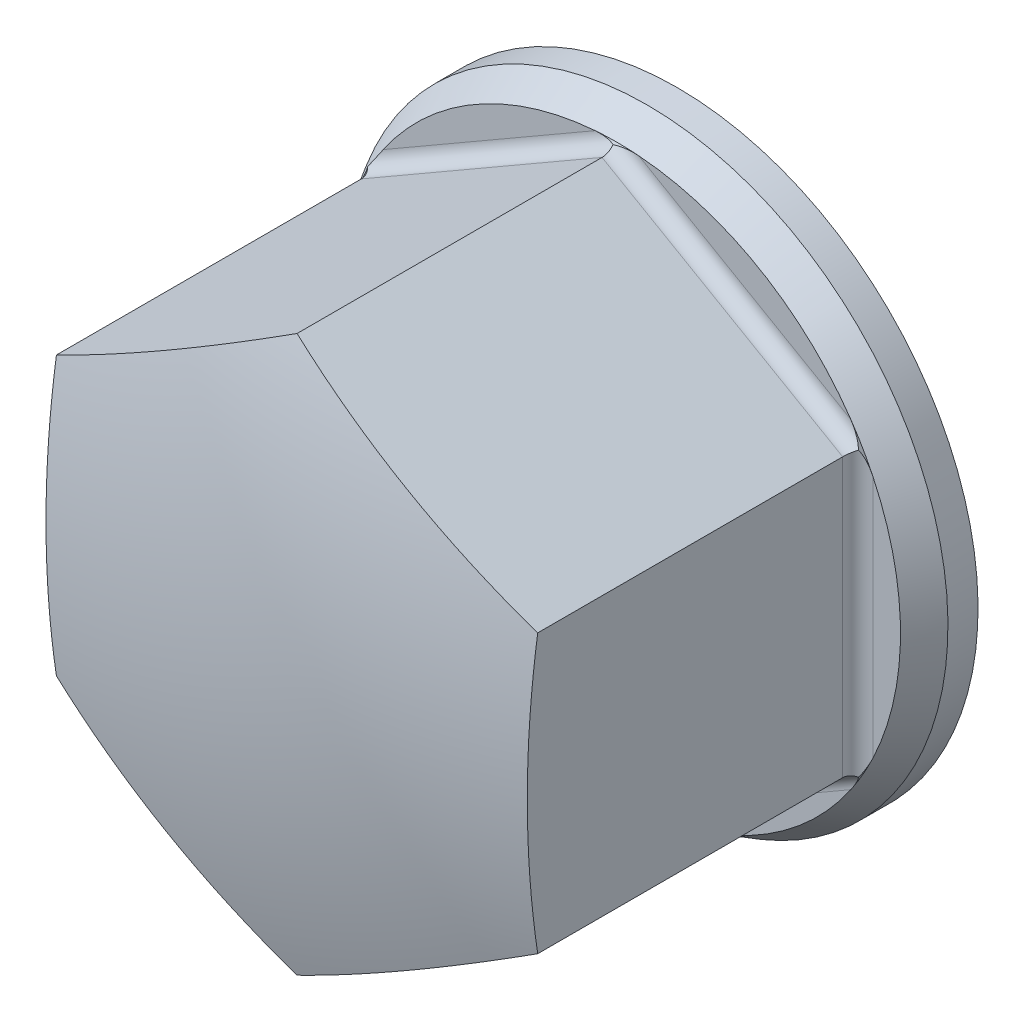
ISO-10303-21;
HEADER;
FILE_DESCRIPTION(('STEP AP214'),'2;1');
FILE_NAME('part.step','',(''),(''),'','','');
FILE_SCHEMA(('AUTOMOTIVE_DESIGN { 1 0 10303 214 1 1 1 1 }'));
ENDSEC;
DATA;
#1=APPLICATION_CONTEXT('core data for automotive mechanical design processes');
#2=APPLICATION_PROTOCOL_DEFINITION('international standard','automotive_design',2000,#1);
#3=PRODUCT_CONTEXT('',#1,'mechanical');
#4=PRODUCT('Part','Part','',(#3));
#5=PRODUCT_RELATED_PRODUCT_CATEGORY('part','',(#4));
#6=PRODUCT_DEFINITION_FORMATION('','',#4);
#7=PRODUCT_DEFINITION_CONTEXT('part definition',#1,'design');
#8=PRODUCT_DEFINITION('design','',#6,#7);
#9=PRODUCT_DEFINITION_SHAPE('','',#8);
#10=(LENGTH_UNIT() NAMED_UNIT(*) SI_UNIT(.MILLI.,.METRE.));
#11=(NAMED_UNIT(*) PLANE_ANGLE_UNIT() SI_UNIT($,.RADIAN.));
#12=(NAMED_UNIT(*) SI_UNIT($,.STERADIAN.) SOLID_ANGLE_UNIT());
#13=UNCERTAINTY_MEASURE_WITH_UNIT(LENGTH_MEASURE(1.E-05),#10,'distance_accuracy_value','');
#14=(GEOMETRIC_REPRESENTATION_CONTEXT(3) GLOBAL_UNCERTAINTY_ASSIGNED_CONTEXT((#13)) GLOBAL_UNIT_ASSIGNED_CONTEXT((#10,
#11,#12)) REPRESENTATION_CONTEXT('',''));
#15=CARTESIAN_POINT('',(0.,0.,0.));
#16=DIRECTION('',(0.,0.,1.));
#17=DIRECTION('',(1.,0.,0.));
#18=AXIS2_PLACEMENT_3D('',#15,#16,#17);
#19=CARTESIAN_POINT('',(0.,0.,0.));
#20=DIRECTION('',(0.,0.,-1.));
#21=DIRECTION('',(0.,1.,0.));
#22=AXIS2_PLACEMENT_3D('',#19,#20,#21);
#23=CYLINDRICAL_SURFACE('',#22,10.);
#24=CARTESIAN_POINT('',(0.,0.,0.));
#25=DIRECTION('',(0.,0.,-1.));
#26=DIRECTION('',(0.,1.,0.));
#27=AXIS2_PLACEMENT_3D('',#24,#25,#26);
#28=CIRCLE('',#27,10.);
#29=CARTESIAN_POINT('',(0.,10.,0.));
#30=VERTEX_POINT('',#29);
#31=EDGE_CURVE('E177',#30,#30,#28,.T.);
#32=ORIENTED_EDGE('',*,*,#31,.F.);
#33=EDGE_LOOP('',(#32));
#34=FACE_BOUND('',#33,.T.);
#35=CARTESIAN_POINT('',(0.,0.,1.));
#36=DIRECTION('',(0.,0.,-1.));
#37=DIRECTION('',(0.,1.,0.));
#38=AXIS2_PLACEMENT_3D('',#35,#36,#37);
#39=CIRCLE('',#38,10.);
#40=CARTESIAN_POINT('',(0.,10.,1.));
#41=VERTEX_POINT('',#40);
#42=EDGE_CURVE('E138',#41,#41,#39,.T.);
#43=ORIENTED_EDGE('',*,*,#42,.T.);
#44=EDGE_LOOP('',(#43));
#45=FACE_BOUND('',#44,.T.);
#46=ADVANCED_FACE('F14',(#34,#45),#23,.T.);
#47=CARTESIAN_POINT('',(10.,0.,0.));
#48=DIRECTION('',(0.,0.,1.));
#49=DIRECTION('',(0.,-1.,0.));
#50=AXIS2_PLACEMENT_3D('',#47,#48,#49);
#51=PLANE('',#50);
#52=CARTESIAN_POINT('',(0.,0.,0.));
#53=DIRECTION('',(0.,0.,-1.));
#54=DIRECTION('',(0.,1.,0.));
#55=AXIS2_PLACEMENT_3D('',#52,#53,#54);
#56=CIRCLE('',#55,5.);
#57=CARTESIAN_POINT('',(0.,5.,0.));
#58=VERTEX_POINT('',#57);
#59=EDGE_CURVE('E324',#58,#58,#56,.T.);
#60=ORIENTED_EDGE('',*,*,#59,.F.);
#61=EDGE_LOOP('',(#60));
#62=FACE_BOUND('',#61,.T.);
#63=ORIENTED_EDGE('',*,*,#31,.T.);
#64=EDGE_LOOP('',(#63));
#65=FACE_BOUND('',#64,.T.);
#66=ADVANCED_FACE('F308',(#62,#65),#51,.F.);
#67=CARTESIAN_POINT('',(0.,0.,1.));
#68=DIRECTION('',(0.,0.,-1.));
#69=DIRECTION('',(0.,1.,0.));
#70=AXIS2_PLACEMENT_3D('',#67,#68,#69);
#71=CYLINDRICAL_SURFACE('',#70,9.42264973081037);
#72=CARTESIAN_POINT('',(-8.00759181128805,-4.96636701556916,2.41320037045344));
#73=CARTESIAN_POINT('',(-8.0109847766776,-4.96089647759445,2.39393214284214));
#74=CARTESIAN_POINT('',(-8.01540686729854,-4.95375420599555,2.37546786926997));
#75=CARTESIAN_POINT('',(-8.02577730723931,-4.93693445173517,2.34050339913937));
#76=CARTESIAN_POINT('',(-8.03170422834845,-4.92729252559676,2.32398003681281));
#77=CARTESIAN_POINT('',(-8.04738313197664,-4.90165892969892,2.28618413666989));
#78=CARTESIAN_POINT('',(-8.05769762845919,-4.88469893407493,2.26581976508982));
#79=CARTESIAN_POINT('',(-8.07972466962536,-4.84817902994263,2.22825561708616));
#80=CARTESIAN_POINT('',(-8.09144646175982,-4.82860181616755,2.21107889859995));
#81=CARTESIAN_POINT('',(-8.12476440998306,-4.77244601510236,2.16771000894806));
#82=CARTESIAN_POINT('',(-8.14717188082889,-4.73413010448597,2.14442021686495));
#83=CARTESIAN_POINT('',(-8.1928389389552,-4.65465887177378,2.10430469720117));
#84=CARTESIAN_POINT('',(-8.21610189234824,-4.61349160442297,2.08750837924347));
#85=CARTESIAN_POINT('',(-8.26197894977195,-4.53080529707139,2.05949616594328));
#86=CARTESIAN_POINT('',(-8.28459069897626,-4.48933713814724,2.04812277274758));
#87=CARTESIAN_POINT('',(-8.32956780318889,-4.40532694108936,2.02931214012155));
#88=CARTESIAN_POINT('',(-8.3519327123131,-4.36278330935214,2.02188114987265));
#89=CARTESIAN_POINT('',(-8.39561284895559,-4.27810964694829,2.01050991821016));
#90=CARTESIAN_POINT('',(-8.41694029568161,-4.23599682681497,2.00648532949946));
#91=CARTESIAN_POINT('',(-8.45895487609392,-4.15146249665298,2.00124553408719));
#92=CARTESIAN_POINT('',(-8.47964401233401,-4.10904261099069,2.00002041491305));
#93=CARTESIAN_POINT('',(-8.5,-4.06648840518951,2.));
#94=B_SPLINE_CURVE_WITH_KNOTS('',3,(#72,#73,#74,#75,#76,#77,#78,#79,#80,#81,#82,#83,#84,#85,#86,
#87,#88,#89,#90,#91,#92,#93),.UNSPECIFIED.,.F.,.F.,(4,2,2,2,2,2,2,2,2,2,4),(0.,
0.0606308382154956,0.120442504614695,0.205296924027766,0.290743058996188,0.440284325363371,
0.590495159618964,0.736028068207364,0.88179097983,1.0238291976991,1.16536369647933),.UNSPECIFIED.);
#95=CARTESIAN_POINT('',(-8.1602540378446,-4.71132486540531,2.13315850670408));
#96=VERTEX_POINT('',#95);
#97=CARTESIAN_POINT('',(-8.5,-4.06648840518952,2.));
#98=VERTEX_POINT('',#97);
#99=EDGE_CURVE('E272',#96,#98,#94,.T.);
#100=ORIENTED_EDGE('',*,*,#99,.T.);
#101=CARTESIAN_POINT('',(0.,0.,2.));
#102=DIRECTION('',(0.,0.,-1.));
#103=DIRECTION('',(0.,1.,0.));
#104=AXIS2_PLACEMENT_3D('',#101,#102,#103);
#105=CIRCLE('',#104,9.42264973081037);
#106=CARTESIAN_POINT('',(-7.77168226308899,-5.32797172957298,2.));
#107=VERTEX_POINT('',#106);
#108=EDGE_CURVE('E570',#107,#98,#105,.T.);
#109=ORIENTED_EDGE('',*,*,#108,.F.);
#110=CARTESIAN_POINT('',(-7.77168226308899,-5.32797172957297,2.));
#111=CARTESIAN_POINT('',(-7.78779460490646,-5.30446944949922,2.00000178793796));
#112=CARTESIAN_POINT('',(-7.80379916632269,-5.28089548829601,2.00045345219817));
#113=CARTESIAN_POINT('',(-7.83558170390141,-5.23362198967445,2.00232331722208));
#114=CARTESIAN_POINT('',(-7.85135959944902,-5.20992241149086,2.00374185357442));
#115=CARTESIAN_POINT('',(-7.89858518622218,-5.13828433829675,2.00958035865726));
#116=CARTESIAN_POINT('',(-7.92965117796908,-5.09020558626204,2.01558560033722));
#117=CARTESIAN_POINT('',(-7.99099954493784,-4.99335495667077,2.03272252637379));
#118=CARTESIAN_POINT('',(-8.02126182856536,-4.94458410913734,2.04393358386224));
#119=CARTESIAN_POINT('',(-8.07999486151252,-4.84800722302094,2.07272960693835));
#120=CARTESIAN_POINT('',(-8.10847236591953,-4.80019807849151,2.09028859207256));
#121=CARTESIAN_POINT('',(-8.15048033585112,-4.72830463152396,2.12384250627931));
#122=CARTESIAN_POINT('',(-8.16489396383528,-4.70336321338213,2.13688485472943));
#123=CARTESIAN_POINT('',(-8.19278750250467,-4.65460498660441,2.16596080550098));
#124=CARTESIAN_POINT('',(-8.20626546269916,-4.63079055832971,2.18200041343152));
#125=CARTESIAN_POINT('',(-8.23207691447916,-4.58475130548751,2.2179133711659));
#126=CARTESIAN_POINT('',(-8.24438857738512,-4.56255811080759,2.23784409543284));
#127=CARTESIAN_POINT('',(-8.26684174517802,-4.52174621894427,2.28193293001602));
#128=CARTESIAN_POINT('',(-8.27700203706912,-4.5030967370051,2.30605078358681));
#129=CARTESIAN_POINT('',(-8.28956470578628,-4.47990171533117,2.34487194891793));
#130=CARTESIAN_POINT('',(-8.29323035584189,-4.47310918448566,2.35782041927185));
#131=CARTESIAN_POINT('',(-8.29971129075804,-4.46107232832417,2.38476480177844));
#132=CARTESIAN_POINT('',(-8.30251826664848,-4.45584314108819,2.39876940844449));
#133=CARTESIAN_POINT('',(-8.30479590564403,-4.45159442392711,2.41320037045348));
#134=B_SPLINE_CURVE_WITH_KNOTS('',3,(#110,#111,#112,#113,#114,#115,#116,#117,#118,#119,#120,
#121,#122,#123,#124,#125,#126,#127,#128,#129,#130,#131,#132,#133),.UNSPECIFIED.,.F.,.F.,(4,2,2,
2,2,2,2,2,2,2,2,4),(0.,0.0854762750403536,0.170982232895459,0.343442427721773,0.518623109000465,
0.693094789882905,0.787830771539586,0.88275865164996,0.979209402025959,1.07477957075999,
1.11987650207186,1.16539693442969),.UNSPECIFIED.);
#135=EDGE_CURVE('E267',#107,#96,#134,.T.);
#136=ORIENTED_EDGE('',*,*,#135,.T.);
#137=EDGE_LOOP('',(#100,#109,#136));
#138=FACE_BOUND('',#137,.T.);
#139=ADVANCED_FACE('F202',(#138),#71,.T.);
#140=CARTESIAN_POINT('',(8.00759181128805,4.96636701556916,2.41320037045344));
#141=CARTESIAN_POINT('',(8.0109847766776,4.96089647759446,2.39393214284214));
#142=CARTESIAN_POINT('',(8.01540686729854,4.95375420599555,2.37546786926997));
#143=CARTESIAN_POINT('',(8.02577730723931,4.93693445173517,2.34050339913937));
#144=CARTESIAN_POINT('',(8.03170422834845,4.92729252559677,2.3239800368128));
#145=CARTESIAN_POINT('',(8.04738313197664,4.90165892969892,2.28618413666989));
#146=CARTESIAN_POINT('',(8.05769762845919,4.88469893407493,2.26581976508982));
#147=CARTESIAN_POINT('',(8.07972466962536,4.84817902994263,2.22825561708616));
#148=CARTESIAN_POINT('',(8.09144646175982,4.82860181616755,2.21107889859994));
#149=CARTESIAN_POINT('',(8.12476440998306,4.77244601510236,2.16771000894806));
#150=CARTESIAN_POINT('',(8.1471718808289,4.73413010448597,2.14442021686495));
#151=CARTESIAN_POINT('',(8.1928389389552,4.65465887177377,2.10430469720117));
#152=CARTESIAN_POINT('',(8.21610189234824,4.61349160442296,2.08750837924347));
#153=CARTESIAN_POINT('',(8.26197894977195,4.53080529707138,2.05949616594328));
#154=CARTESIAN_POINT('',(8.28459069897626,4.48933713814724,2.04812277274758));
#155=CARTESIAN_POINT('',(8.32956780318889,4.40532694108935,2.02931214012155));
#156=CARTESIAN_POINT('',(8.3519327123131,4.36278330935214,2.02188114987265));
#157=CARTESIAN_POINT('',(8.39561284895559,4.27810964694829,2.01050991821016));
#158=CARTESIAN_POINT('',(8.41694029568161,4.23599682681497,2.00648532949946));
#159=CARTESIAN_POINT('',(8.45895487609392,4.15146249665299,2.00124553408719));
#160=CARTESIAN_POINT('',(8.47964401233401,4.10904261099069,2.00002041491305));
#161=CARTESIAN_POINT('',(8.5,4.06648840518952,2.));
#162=B_SPLINE_CURVE_WITH_KNOTS('',3,(#140,#141,#142,#143,#144,#145,#146,#147,#148,#149,#150,
#151,#152,#153,#154,#155,#156,#157,#158,#159,#160,#161),.UNSPECIFIED.,.F.,.F.,(4,2,2,2,2,2,2,2,
2,2,4),(0.,0.0606308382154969,0.120442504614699,0.20529692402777,0.290743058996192,
0.440284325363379,0.590495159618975,0.73602806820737,0.881790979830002,1.0238291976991,
1.16536369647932),.UNSPECIFIED.);
#163=CARTESIAN_POINT('',(8.1602540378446,4.71132486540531,2.13315850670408));
#164=VERTEX_POINT('',#163);
#165=CARTESIAN_POINT('',(8.5,4.06648840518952,2.));
#166=VERTEX_POINT('',#165);
#167=EDGE_CURVE('E261',#164,#166,#162,.T.);
#168=ORIENTED_EDGE('',*,*,#167,.T.);
#169=CARTESIAN_POINT('',(7.77168226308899,5.32797172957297,2.));
#170=VERTEX_POINT('',#169);
#171=EDGE_CURVE('E134',#170,#166,#105,.T.);
#172=ORIENTED_EDGE('',*,*,#171,.F.);
#173=CARTESIAN_POINT('',(7.77168226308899,5.32797172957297,2.));
#174=CARTESIAN_POINT('',(7.78779460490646,5.30446944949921,2.00000178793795));
#175=CARTESIAN_POINT('',(7.80379916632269,5.280895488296,2.00045345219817));
#176=CARTESIAN_POINT('',(7.83558170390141,5.23362198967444,2.00232331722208));
#177=CARTESIAN_POINT('',(7.85135959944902,5.20992241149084,2.00374185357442));
#178=CARTESIAN_POINT('',(7.89858518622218,5.13828433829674,2.00958035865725));
#179=CARTESIAN_POINT('',(7.92965117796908,5.09020558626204,2.01558560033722));
#180=CARTESIAN_POINT('',(7.99099954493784,4.99335495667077,2.03272252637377));
#181=CARTESIAN_POINT('',(8.02126182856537,4.94458410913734,2.04393358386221));
#182=CARTESIAN_POINT('',(8.07999486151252,4.84800722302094,2.07272960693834));
#183=CARTESIAN_POINT('',(8.10847236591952,4.80019807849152,2.09028859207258));
#184=CARTESIAN_POINT('',(8.15048033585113,4.72830463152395,2.1238425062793));
#185=CARTESIAN_POINT('',(8.16489396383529,4.70336321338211,2.13688485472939));
#186=CARTESIAN_POINT('',(8.19278750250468,4.65460498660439,2.16596080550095));
#187=CARTESIAN_POINT('',(8.20626546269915,4.63079055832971,2.18200041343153));
#188=CARTESIAN_POINT('',(8.23207691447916,4.58475130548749,2.2179133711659));
#189=CARTESIAN_POINT('',(8.24438857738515,4.56255811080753,2.23784409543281));
#190=CARTESIAN_POINT('',(8.26684174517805,4.52174621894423,2.281932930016));
#191=CARTESIAN_POINT('',(8.27700203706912,4.50309673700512,2.30605078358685));
#192=CARTESIAN_POINT('',(8.2895647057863,4.47990171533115,2.34487194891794));
#193=CARTESIAN_POINT('',(8.29323035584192,4.47310918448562,2.35782041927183));
#194=CARTESIAN_POINT('',(8.29971129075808,4.46107232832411,2.38476480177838));
#195=CARTESIAN_POINT('',(8.30251826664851,4.45584314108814,2.39876940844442));
#196=CARTESIAN_POINT('',(8.30479590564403,4.45159442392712,2.41320037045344));
#197=B_SPLINE_CURVE_WITH_KNOTS('',3,(#173,#174,#175,#176,#177,#178,#179,#180,#181,#182,#183,
#184,#185,#186,#187,#188,#189,#190,#191,#192,#193,#194,#195,#196),.UNSPECIFIED.,.F.,.F.,(4,2,2,
2,2,2,2,2,2,2,2,4),(0.,0.0854762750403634,0.170982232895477,0.343442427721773,0.518623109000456,
0.693094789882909,0.787830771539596,0.882758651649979,0.979209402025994,1.07477957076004,
1.11987650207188,1.16539693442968),.UNSPECIFIED.);
#198=EDGE_CURVE('E255',#170,#164,#197,.T.);
#199=ORIENTED_EDGE('',*,*,#198,.T.);
#200=EDGE_LOOP('',(#168,#172,#199));
#201=FACE_BOUND('',#200,.T.);
#202=ADVANCED_FACE('F480',(#201),#71,.T.);
#203=CARTESIAN_POINT('',(-8.5,4.06648840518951,2.));
#204=CARTESIAN_POINT('',(-8.48770259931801,4.09219324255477,2.00000178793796));
#205=CARTESIAN_POINT('',(-8.47528923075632,4.11784057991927,2.00045345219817));
#206=CARTESIAN_POINT('',(-8.45024044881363,4.16900181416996,2.00232331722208));
#207=CARTESIAN_POINT('',(-8.43760495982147,4.19451566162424,2.00374185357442));
#208=CARTESIAN_POINT('',(-8.39917736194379,4.27123325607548,2.00958035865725));
#209=CARTESIAN_POINT('',(-8.37307293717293,4.3221765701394,2.01558560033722));
#210=CARTESIAN_POINT('',(-8.31987201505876,4.42373112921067,2.03272252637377));
#211=CARTESIAN_POINT('',(-8.29276636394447,4.47432445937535,2.04393358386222));
#212=CARTESIAN_POINT('',(-8.23849484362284,4.57347720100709,2.07272960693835));
#213=CARTESIAN_POINT('',(-8.21132966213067,4.62204401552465,2.09028859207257));
#214=CARTESIAN_POINT('',(-8.17007209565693,4.69437070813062,2.12384250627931));
#215=CARTESIAN_POINT('',(-8.15567900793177,4.71932398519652,2.1368848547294));
#216=CARTESIAN_POINT('',(-8.12739991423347,4.76785961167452,2.16596080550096));
#217=CARTESIAN_POINT('',(-8.11351499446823,4.79143908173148,2.18200041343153));
#218=CARTESIAN_POINT('',(-8.08654955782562,4.83681208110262,2.2179133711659));
#219=CARTESIAN_POINT('',(-8.07348551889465,4.858570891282,2.23784409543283));
#220=CARTESIAN_POINT('',(-8.04936796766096,4.89842185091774,2.28193293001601));
#221=CARTESIAN_POINT('',(-8.03829718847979,4.91654566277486,2.30605078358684));
#222=CARTESIAN_POINT('',(-8.02449104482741,4.93902276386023,2.34487194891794));
#223=CARTESIAN_POINT('',(-8.02044136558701,4.94559357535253,2.35782041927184));
#224=CARTESIAN_POINT('',(-8.01325760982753,4.95722465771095,2.3847648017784));
#225=CARTESIAN_POINT('',(-8.01013248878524,4.96227016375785,2.39876940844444));
#226=CARTESIAN_POINT('',(-8.00759181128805,4.96636701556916,2.41320037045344));
#227=B_SPLINE_CURVE_WITH_KNOTS('',3,(#203,#204,#205,#206,#207,#208,#209,#210,#211,#212,#213,
#214,#215,#216,#217,#218,#219,#220,#221,#222,#223,#224,#225,#226),.UNSPECIFIED.,.F.,.F.,(4,2,2,
2,2,2,2,2,2,2,2,4),(0.,0.0854762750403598,0.170982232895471,0.343442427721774,0.518623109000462,
0.693094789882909,0.787830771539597,0.882758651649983,0.979209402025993,1.07477957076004,
1.11987650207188,1.16539693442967),.UNSPECIFIED.);
#228=CARTESIAN_POINT('',(-8.5,4.06648840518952,2.));
#229=VERTEX_POINT('',#228);
#230=CARTESIAN_POINT('',(-8.16025403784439,4.71132486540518,2.13315850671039));
#231=VERTEX_POINT('',#230);
#232=EDGE_CURVE('E247',#229,#231,#227,.T.);
#233=ORIENTED_EDGE('',*,*,#232,.T.);
#234=CARTESIAN_POINT('',(-8.30479590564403,4.45159442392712,2.41320037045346));
#235=CARTESIAN_POINT('',(-8.30175476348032,4.45726808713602,2.39393214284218));
#236=CARTESIAN_POINT('',(-8.29778042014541,4.46466886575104,2.37546786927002));
#237=CARTESIAN_POINT('',(-8.2883993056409,4.48205980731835,2.3405033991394));
#238=CARTESIAN_POINT('',(-8.28301261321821,4.49201363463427,2.32398003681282));
#239=CARTESIAN_POINT('',(-8.26865271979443,4.51840876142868,2.28618413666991));
#240=CARTESIAN_POINT('',(-8.25912218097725,4.53582137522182,2.26581976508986));
#241=CARTESIAN_POINT('',(-8.23850853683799,4.57315730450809,2.2282556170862));
#242=CARTESIAN_POINT('',(-8.22741506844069,4.59309728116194,2.21107889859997));
#243=CARTESIAN_POINT('',(-8.19544169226,4.6500293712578,2.16771000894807));
#244=CARTESIAN_POINT('',(-8.17346287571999,4.68859276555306,2.14442021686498));
#245=CARTESIAN_POINT('',(-8.12747229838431,4.76787721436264,2.10430469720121));
#246=CARTESIAN_POINT('',(-8.10345187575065,4.80860715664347,2.08750837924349));
#247=CARTESIAN_POINT('',(-8.05478196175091,4.88968100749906,2.05949616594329));
#248=CARTESIAN_POINT('',(-8.03017535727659,4.92999743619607,2.0481227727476));
#249=CARTESIAN_POINT('',(-7.97990894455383,5.01095384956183,2.02931214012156));
#250=CARTESIAN_POINT('',(-7.95424753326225,5.05159424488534,2.02188114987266));
#251=CARTESIAN_POINT('',(-7.90275805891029,5.13175918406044,2.01050991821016));
#252=CARTESIAN_POINT('',(-7.87695101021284,5.1712857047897,2.00648532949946));
#253=CARTESIAN_POINT('',(-7.82474942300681,5.2499385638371,2.00124553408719));
#254=CARTESIAN_POINT('',(-7.79835729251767,5.28906582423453,2.00002041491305));
#255=CARTESIAN_POINT('',(-7.77168226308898,5.32797172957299,2.));
#256=B_SPLINE_CURVE_WITH_KNOTS('',3,(#234,#235,#236,#237,#238,#239,#240,#241,#242,#243,#244,
#245,#246,#247,#248,#249,#250,#251,#252,#253,#254,#255),.UNSPECIFIED.,.F.,.F.,(4,2,2,2,2,2,2,2,
2,2,4),(0.,0.06063083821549,0.120442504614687,0.205296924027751,0.290743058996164,
0.440284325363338,0.590495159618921,0.736028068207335,0.88179097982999,1.0238291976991,
1.16536369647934),.UNSPECIFIED.);
#257=CARTESIAN_POINT('',(-7.77168226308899,5.32797172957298,2.));
#258=VERTEX_POINT('',#257);
#259=EDGE_CURVE('E240',#231,#258,#256,.T.);
#260=ORIENTED_EDGE('',*,*,#259,.T.);
#261=EDGE_CURVE('E583',#229,#258,#105,.T.);
#262=ORIENTED_EDGE('',*,*,#261,.F.);
#263=EDGE_LOOP('',(#233,#260,#262));
#264=FACE_BOUND('',#263,.T.);
#265=ADVANCED_FACE('F473',(#264),#71,.T.);
#266=CARTESIAN_POINT('',(-0.297204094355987,9.41796143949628,2.41320037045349));
#267=CARTESIAN_POINT('',(-0.290769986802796,9.41816456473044,2.39393214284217));
#268=CARTESIAN_POINT('',(-0.282373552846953,9.41842307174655,2.37546786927));
#269=CARTESIAN_POINT('',(-0.262621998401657,9.41899425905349,2.34050339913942));
#270=CARTESIAN_POINT('',(-0.251308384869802,9.41930616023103,2.32398003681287));
#271=CARTESIAN_POINT('',(-0.221269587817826,9.42006769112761,2.28618413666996));
#272=CARTESIAN_POINT('',(-0.201424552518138,9.42052030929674,2.26581976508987));
#273=CARTESIAN_POINT('',(-0.158783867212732,9.42133633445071,2.2282556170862));
#274=CARTESIAN_POINT('',(-0.135968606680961,9.4216990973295,2.21107889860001));
#275=CARTESIAN_POINT('',(-0.0706772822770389,9.4224753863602,2.16771000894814));
#276=CARTESIAN_POINT('',(-0.0262909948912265,9.42272287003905,2.14442021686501));
#277=CARTESIAN_POINT('',(0.0653666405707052,9.42253608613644,2.10430469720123));
#278=CARTESIAN_POINT('',(0.112650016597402,9.42209876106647,2.08750837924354));
#279=CARTESIAN_POINT('',(0.207196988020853,9.42048630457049,2.05949616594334));
#280=CARTESIAN_POINT('',(0.254415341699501,9.41933457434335,2.04812277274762));
#281=CARTESIAN_POINT('',(0.349658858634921,9.4162807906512,2.02931214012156));
#282=CARTESIAN_POINT('',(0.397685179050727,9.41437755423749,2.02188114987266));
#283=CARTESIAN_POINT('',(0.492854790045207,9.40986883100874,2.01050991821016));
#284=CARTESIAN_POINT('',(0.539989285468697,9.40728253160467,2.00648532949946));
#285=CARTESIAN_POINT('',(0.634205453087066,9.40140106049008,2.00124553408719));
#286=CARTESIAN_POINT('',(0.68128671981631,9.39810843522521,2.00002041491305));
#287=CARTESIAN_POINT('',(0.728317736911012,9.39446013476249,2.));
#288=B_SPLINE_CURVE_WITH_KNOTS('',3,(#266,#267,#268,#269,#270,#271,#272,#273,#274,#275,#276,
#277,#278,#279,#280,#281,#282,#283,#284,#285,#286,#287),.UNSPECIFIED.,.F.,.F.,(4,2,2,2,2,2,2,2,
2,2,4),(0.,0.0606308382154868,0.120442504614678,0.20529692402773,0.29074305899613,
0.440284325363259,0.590495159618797,0.73602806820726,0.881790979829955,1.02382919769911,
1.16536369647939),.UNSPECIFIED.);
#289=CARTESIAN_POINT('',(0.,9.42264973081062,2.13315850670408));
#290=VERTEX_POINT('',#289);
#291=CARTESIAN_POINT('',(0.72831773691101,9.39446013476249,2.));
#292=VERTEX_POINT('',#291);
#293=EDGE_CURVE('E233',#290,#292,#288,.T.);
#294=ORIENTED_EDGE('',*,*,#293,.T.);
#295=CARTESIAN_POINT('',(-0.728317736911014,9.39446013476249,2.));
#296=VERTEX_POINT('',#295);
#297=EDGE_CURVE('E590',#296,#292,#105,.T.);
#298=ORIENTED_EDGE('',*,*,#297,.F.);
#299=CARTESIAN_POINT('',(-0.728317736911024,9.39446013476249,2.));
#300=CARTESIAN_POINT('',(-0.699907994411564,9.396662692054,2.00000178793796));
#301=CARTESIAN_POINT('',(-0.671490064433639,9.39873606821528,2.00045345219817));
#302=CARTESIAN_POINT('',(-0.614658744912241,9.4026238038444,2.00232331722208));
#303=CARTESIAN_POINT('',(-0.586245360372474,9.40443807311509,2.00374185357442));
#304=CARTESIAN_POINT('',(-0.500592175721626,9.40951759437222,2.00958035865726));
#305=CARTESIAN_POINT('',(-0.44342175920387,9.41238215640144,2.01558560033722));
#306=CARTESIAN_POINT('',(-0.328872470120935,9.41708608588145,2.03272252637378));
#307=CARTESIAN_POINT('',(-0.271504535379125,9.4189085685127,2.04393358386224));
#308=CARTESIAN_POINT('',(-0.158499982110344,9.42148442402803,2.07272960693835));
#309=CARTESIAN_POINT('',(-0.102857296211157,9.42224209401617,2.09028859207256));
#310=CARTESIAN_POINT('',(-0.0195917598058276,9.42267533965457,2.12384250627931));
#311=CARTESIAN_POINT('',(0.00921495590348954,9.42268719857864,2.13688485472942));
#312=CARTESIAN_POINT('',(0.0653875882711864,9.42246459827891,2.16596080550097));
#313=CARTESIAN_POINT('',(0.092750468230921,9.42222964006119,2.18200041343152));
#314=CARTESIAN_POINT('',(0.145527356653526,9.42156338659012,2.2179133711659));
#315=CARTESIAN_POINT('',(0.170903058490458,9.42112900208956,2.23784409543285));
#316=CARTESIAN_POINT('',(0.21747377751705,9.42016806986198,2.28193293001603));
#317=CARTESIAN_POINT('',(0.238704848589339,9.41964239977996,2.30605078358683));
#318=CARTESIAN_POINT('',(0.265073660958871,9.41892447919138,2.34487194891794));
#319=CARTESIAN_POINT('',(0.272788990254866,9.41870275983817,2.35782041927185));
#320=CARTESIAN_POINT('',(0.286453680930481,9.41829698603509,2.38476480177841));
#321=CARTESIAN_POINT('',(0.292385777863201,9.41811330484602,2.39876940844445));
#322=CARTESIAN_POINT('',(0.297204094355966,9.41796143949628,2.41320037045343));
#323=B_SPLINE_CURVE_WITH_KNOTS('',3,(#299,#300,#301,#302,#303,#304,#305,#306,#307,#308,#309,
#310,#311,#312,#313,#314,#315,#316,#317,#318,#319,#320,#321,#322),.UNSPECIFIED.,.F.,.F.,(4,2,2,
2,2,2,2,2,2,2,2,4),(0.,0.0854762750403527,0.170982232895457,0.343442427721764,0.518623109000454,
0.693094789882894,0.787830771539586,0.882758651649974,0.979209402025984,1.07477957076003,
1.11987650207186,1.16539693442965),.UNSPECIFIED.);
#324=EDGE_CURVE('E153',#296,#290,#323,.T.);
#325=ORIENTED_EDGE('',*,*,#324,.T.);
#326=EDGE_LOOP('',(#294,#298,#325));
#327=FACE_BOUND('',#326,.T.);
#328=ADVANCED_FACE('F467',(#327),#71,.T.);
#329=CARTESIAN_POINT('',(8.5,-4.06648840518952,2.));
#330=CARTESIAN_POINT('',(8.48770259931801,-4.09219324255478,2.00000178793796));
#331=CARTESIAN_POINT('',(8.47528923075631,-4.11784057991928,2.00045345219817));
#332=CARTESIAN_POINT('',(8.45024044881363,-4.16900181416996,2.00232331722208));
#333=CARTESIAN_POINT('',(8.43760495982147,-4.19451566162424,2.00374185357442));
#334=CARTESIAN_POINT('',(8.39917736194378,-4.27123325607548,2.00958035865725));
#335=CARTESIAN_POINT('',(8.37307293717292,-4.32217657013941,2.01558560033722));
#336=CARTESIAN_POINT('',(8.31987201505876,-4.42373112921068,2.03272252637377));
#337=CARTESIAN_POINT('',(8.29276636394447,-4.47432445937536,2.04393358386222));
#338=CARTESIAN_POINT('',(8.23849484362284,-4.5734772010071,2.07272960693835));
#339=CARTESIAN_POINT('',(8.21132966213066,-4.62204401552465,2.09028859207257));
#340=CARTESIAN_POINT('',(8.17007209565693,-4.69437070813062,2.12384250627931));
#341=CARTESIAN_POINT('',(8.15567900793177,-4.71932398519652,2.1368848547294));
#342=CARTESIAN_POINT('',(8.12739991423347,-4.76785961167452,2.16596080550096));
#343=CARTESIAN_POINT('',(8.11351499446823,-4.79143908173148,2.18200041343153));
#344=CARTESIAN_POINT('',(8.08654955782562,-4.83681208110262,2.2179133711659));
#345=CARTESIAN_POINT('',(8.07348551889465,-4.858570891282,2.23784409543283));
#346=CARTESIAN_POINT('',(8.04936796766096,-4.89842185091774,2.28193293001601));
#347=CARTESIAN_POINT('',(8.03829718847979,-4.91654566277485,2.30605078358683));
#348=CARTESIAN_POINT('',(8.02449104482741,-4.93902276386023,2.34487194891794));
#349=CARTESIAN_POINT('',(8.02044136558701,-4.94559357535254,2.35782041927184));
#350=CARTESIAN_POINT('',(8.01325760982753,-4.95722465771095,2.3847648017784));
#351=CARTESIAN_POINT('',(8.01013248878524,-4.96227016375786,2.39876940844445));
#352=CARTESIAN_POINT('',(8.00759181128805,-4.96636701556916,2.41320037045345));
#353=B_SPLINE_CURVE_WITH_KNOTS('',3,(#329,#330,#331,#332,#333,#334,#335,#336,#337,#338,#339,
#340,#341,#342,#343,#344,#345,#346,#347,#348,#349,#350,#351,#352),.UNSPECIFIED.,.F.,.F.,(4,2,2,
2,2,2,2,2,2,2,2,4),(0.,0.0854762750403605,0.170982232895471,0.343442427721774,0.518623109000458,
0.6930947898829,0.787830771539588,0.882758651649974,0.979209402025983,1.07477957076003,
1.11987650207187,1.16539693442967),.UNSPECIFIED.);
#354=CARTESIAN_POINT('',(8.5,-4.06648840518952,2.));
#355=VERTEX_POINT('',#354);
#356=CARTESIAN_POINT('',(8.16025403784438,-4.71132486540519,2.13315850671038));
#357=VERTEX_POINT('',#356);
#358=EDGE_CURVE('E143',#355,#357,#353,.T.);
#359=ORIENTED_EDGE('',*,*,#358,.T.);
#360=CARTESIAN_POINT('',(8.30479590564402,-4.45159442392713,2.41320037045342));
#361=CARTESIAN_POINT('',(8.30175476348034,-4.45726808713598,2.3939321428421));
#362=CARTESIAN_POINT('',(8.29778042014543,-4.464668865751,2.37546786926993));
#363=CARTESIAN_POINT('',(8.28839930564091,-4.48205980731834,2.34050339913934));
#364=CARTESIAN_POINT('',(8.2830126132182,-4.49201363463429,2.32398003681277));
#365=CARTESIAN_POINT('',(8.26865271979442,-4.51840876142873,2.28618413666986));
#366=CARTESIAN_POINT('',(8.25912218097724,-4.53582137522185,2.26581976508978));
#367=CARTESIAN_POINT('',(8.23850853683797,-4.57315730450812,2.22825561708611));
#368=CARTESIAN_POINT('',(8.22741506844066,-4.59309728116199,2.2110788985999));
#369=CARTESIAN_POINT('',(8.19544169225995,-4.6500293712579,2.16771000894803));
#370=CARTESIAN_POINT('',(8.17346287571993,-4.68859276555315,2.1444202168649));
#371=CARTESIAN_POINT('',(8.12747229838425,-4.76787721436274,2.10430469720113));
#372=CARTESIAN_POINT('',(8.10345187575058,-4.80860715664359,2.08750837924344));
#373=CARTESIAN_POINT('',(8.05478196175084,-4.88968100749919,2.05949616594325));
#374=CARTESIAN_POINT('',(8.03017535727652,-4.92999743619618,2.04812277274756));
#375=CARTESIAN_POINT('',(7.97990894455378,-5.01095384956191,2.02931214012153));
#376=CARTESIAN_POINT('',(7.95424753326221,-5.0515942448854,2.02188114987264));
#377=CARTESIAN_POINT('',(7.90275805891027,-5.13175918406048,2.01050991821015));
#378=CARTESIAN_POINT('',(7.87695101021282,-5.17128570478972,2.00648532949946));
#379=CARTESIAN_POINT('',(7.8247494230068,-5.2499385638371,2.00124553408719));
#380=CARTESIAN_POINT('',(7.79835729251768,-5.28906582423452,2.00002041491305));
#381=CARTESIAN_POINT('',(7.77168226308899,-5.32797172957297,2.));
#382=B_SPLINE_CURVE_WITH_KNOTS('',3,(#360,#361,#362,#363,#364,#365,#366,#367,#368,#369,#370,
#371,#372,#373,#374,#375,#376,#377,#378,#379,#380,#381),.UNSPECIFIED.,.F.,.F.,(4,2,2,2,2,2,2,2,
2,2,4),(0.,0.0606308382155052,0.120442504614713,0.2052969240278,0.290743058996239,
0.44028432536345,0.59049515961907,0.736028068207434,0.881790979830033,1.0238291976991,
1.1653636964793),.UNSPECIFIED.);
#383=CARTESIAN_POINT('',(7.77168226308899,-5.32797172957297,2.));
#384=VERTEX_POINT('',#383);
#385=EDGE_CURVE('E9',#357,#384,#382,.T.);
#386=ORIENTED_EDGE('',*,*,#385,.T.);
#387=EDGE_CURVE('E132',#355,#384,#105,.T.);
#388=ORIENTED_EDGE('',*,*,#387,.F.);
#389=EDGE_LOOP('',(#359,#386,#388));
#390=FACE_BOUND('',#389,.T.);
#391=ADVANCED_FACE('F142',(#390),#71,.T.);
#392=CARTESIAN_POINT('',(0.297204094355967,-9.41796143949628,2.41320037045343));
#393=CARTESIAN_POINT('',(0.29076998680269,-9.41816456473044,2.39393214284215));
#394=CARTESIAN_POINT('',(0.282373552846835,-9.41842307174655,2.37546786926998));
#395=CARTESIAN_POINT('',(0.262621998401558,-9.4189942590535,2.34050339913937));
#396=CARTESIAN_POINT('',(0.251308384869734,-9.41930616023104,2.32398003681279));
#397=CARTESIAN_POINT('',(0.221269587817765,-9.42006769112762,2.28618413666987));
#398=CARTESIAN_POINT('',(0.201424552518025,-9.42052030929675,2.26581976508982));
#399=CARTESIAN_POINT('',(0.158783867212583,-9.42133633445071,2.22825561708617));
#400=CARTESIAN_POINT('',(0.13596860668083,-9.4216990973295,2.21107889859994));
#401=CARTESIAN_POINT('',(0.0706772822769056,-9.4224753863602,2.16771000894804));
#402=CARTESIAN_POINT('',(0.0262909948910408,-9.42272287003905,2.14442021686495));
#403=CARTESIAN_POINT('',(-0.0653666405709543,-9.42253608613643,2.10430469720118));
#404=CARTESIAN_POINT('',(-0.112650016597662,-9.42209876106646,2.08750837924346));
#405=CARTESIAN_POINT('',(-0.207196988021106,-9.42048630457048,2.05949616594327));
#406=CARTESIAN_POINT('',(-0.254415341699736,-9.41933457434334,2.04812277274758));
#407=CARTESIAN_POINT('',(-0.349658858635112,-9.4162807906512,2.02931214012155));
#408=CARTESIAN_POINT('',(-0.397685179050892,-9.41437755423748,2.02188114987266));
#409=CARTESIAN_POINT('',(-0.492854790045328,-9.40986883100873,2.01050991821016));
#410=CARTESIAN_POINT('',(-0.539989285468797,-9.40728253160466,2.00648532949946));
#411=CARTESIAN_POINT('',(-0.634205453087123,-9.40140106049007,2.00124553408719));
#412=CARTESIAN_POINT('',(-0.681286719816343,-9.39810843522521,2.00002041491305));
#413=CARTESIAN_POINT('',(-0.728317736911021,-9.39446013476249,2.));
#414=B_SPLINE_CURVE_WITH_KNOTS('',3,(#392,#393,#394,#395,#396,#397,#398,#399,#400,#401,#402,
#403,#404,#405,#406,#407,#408,#409,#410,#411,#412,#413),.UNSPECIFIED.,.F.,.F.,(4,2,2,2,2,2,2,2,
2,2,4),(0.,0.0606308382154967,0.1204425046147,0.20529692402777,0.290743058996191,
0.440284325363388,0.590495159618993,0.736028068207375,0.881790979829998,1.02382919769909,
1.1653636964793),.UNSPECIFIED.);
#415=CARTESIAN_POINT('',(0.,-9.42264973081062,2.13315850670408));
#416=VERTEX_POINT('',#415);
#417=CARTESIAN_POINT('',(-0.728317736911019,-9.39446013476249,2.));
#418=VERTEX_POINT('',#417);
#419=EDGE_CURVE('E145',#416,#418,#414,.T.);
#420=ORIENTED_EDGE('',*,*,#419,.T.);
#421=CARTESIAN_POINT('',(0.728317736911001,-9.39446013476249,2.));
#422=VERTEX_POINT('',#421);
#423=EDGE_CURVE('E660',#422,#418,#105,.T.);
#424=ORIENTED_EDGE('',*,*,#423,.F.);
#425=CARTESIAN_POINT('',(0.728317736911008,-9.39446013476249,2.));
#426=CARTESIAN_POINT('',(0.699907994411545,-9.396662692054,2.00000178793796));
#427=CARTESIAN_POINT('',(0.671490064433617,-9.39873606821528,2.00045345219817));
#428=CARTESIAN_POINT('',(0.614658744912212,-9.4026238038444,2.00232331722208));
#429=CARTESIAN_POINT('',(0.586245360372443,-9.40443807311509,2.00374185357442));
#430=CARTESIAN_POINT('',(0.500592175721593,-9.40951759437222,2.00958035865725));
#431=CARTESIAN_POINT('',(0.443421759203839,-9.41238215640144,2.01558560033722));
#432=CARTESIAN_POINT('',(0.328872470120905,-9.41708608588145,2.03272252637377));
#433=CARTESIAN_POINT('',(0.271504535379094,-9.4189085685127,2.04393358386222));
#434=CARTESIAN_POINT('',(0.158499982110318,-9.42148442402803,2.07272960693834));
#435=CARTESIAN_POINT('',(0.102857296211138,-9.42224209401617,2.09028859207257));
#436=CARTESIAN_POINT('',(0.0195917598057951,-9.42267533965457,2.12384250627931));
#437=CARTESIAN_POINT('',(-0.00921495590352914,-9.42268719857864,2.1368848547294));
#438=CARTESIAN_POINT('',(-0.0653875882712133,-9.42246459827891,2.16596080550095));
#439=CARTESIAN_POINT('',(-0.0927504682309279,-9.42222964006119,2.18200041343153));
#440=CARTESIAN_POINT('',(-0.145527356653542,-9.42156338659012,2.2179133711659));
#441=CARTESIAN_POINT('',(-0.170903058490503,-9.42112900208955,2.23784409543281));
#442=CARTESIAN_POINT('',(-0.217473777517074,-9.42016806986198,2.281932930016));
#443=CARTESIAN_POINT('',(-0.238704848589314,-9.41964239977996,2.30605078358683));
#444=CARTESIAN_POINT('',(-0.265073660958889,-9.41892447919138,2.34487194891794));
#445=CARTESIAN_POINT('',(-0.272788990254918,-9.41870275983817,2.35782041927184));
#446=CARTESIAN_POINT('',(-0.286453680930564,-9.41829698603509,2.38476480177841));
#447=CARTESIAN_POINT('',(-0.29238577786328,-9.41811330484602,2.39876940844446));
#448=CARTESIAN_POINT('',(-0.297204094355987,-9.41796143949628,2.41320037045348));
#449=B_SPLINE_CURVE_WITH_KNOTS('',3,(#425,#426,#427,#428,#429,#430,#431,#432,#433,#434,#435,
#436,#437,#438,#439,#440,#441,#442,#443,#444,#445,#446,#447,#448),.UNSPECIFIED.,.F.,.F.,(4,2,2,
2,2,2,2,2,2,2,2,4),(0.,0.0854762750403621,0.170982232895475,0.343442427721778,0.518623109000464,
0.693094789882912,0.787830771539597,0.882758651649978,0.979209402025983,1.07477957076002,
1.11987650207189,1.16539693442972),.UNSPECIFIED.);
#450=EDGE_CURVE('E28',#422,#416,#449,.T.);
#451=ORIENTED_EDGE('',*,*,#450,.T.);
#452=EDGE_LOOP('',(#420,#424,#451));
#453=FACE_BOUND('',#452,.T.);
#454=ADVANCED_FACE('F196',(#453),#71,.T.);
#455=CARTESIAN_POINT('',(0.,0.,2.));
#456=DIRECTION('',(0.,0.,-1.));
#457=DIRECTION('',(0.,1.,0.));
#458=AXIS2_PLACEMENT_3D('',#455,#456,#457);
#459=CONICAL_SURFACE('',#458,9.42264973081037,0.523598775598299);
#460=ORIENTED_EDGE('',*,*,#42,.F.);
#461=EDGE_LOOP('',(#460));
#462=FACE_BOUND('',#461,.T.);
#463=EDGE_CURVE('E129',#166,#355,#105,.T.);
#464=ORIENTED_EDGE('',*,*,#463,.T.);
#465=ORIENTED_EDGE('',*,*,#387,.T.);
#466=EDGE_CURVE('E35',#384,#422,#105,.T.);
#467=ORIENTED_EDGE('',*,*,#466,.T.);
#468=ORIENTED_EDGE('',*,*,#423,.T.);
#469=EDGE_CURVE('E582',#418,#107,#105,.T.);
#470=ORIENTED_EDGE('',*,*,#469,.T.);
#471=ORIENTED_EDGE('',*,*,#108,.T.);
#472=EDGE_CURVE('E579',#98,#229,#105,.T.);
#473=ORIENTED_EDGE('',*,*,#472,.T.);
#474=ORIENTED_EDGE('',*,*,#261,.T.);
#475=EDGE_CURVE('E649',#258,#296,#105,.T.);
#476=ORIENTED_EDGE('',*,*,#475,.T.);
#477=ORIENTED_EDGE('',*,*,#297,.T.);
#478=EDGE_CURVE('E650',#292,#170,#105,.T.);
#479=ORIENTED_EDGE('',*,*,#478,.T.);
#480=ORIENTED_EDGE('',*,*,#171,.T.);
#481=EDGE_LOOP('',(#464,#465,#467,#468,#470,#471,#473,#474,#476,#477,#479,#480));
#482=FACE_BOUND('',#481,.T.);
#483=ADVANCED_FACE('F131',(#462,#482),#459,.T.);
#484=CARTESIAN_POINT('',(0.,0.,-18.));
#485=DIRECTION('',(0.,0.,-1.));
#486=DIRECTION('',(1.,0.,0.));
#487=AXIS2_PLACEMENT_3D('',#484,#485,#486);
#488=SPHERICAL_SURFACE('',#487,32.);
#489=CARTESIAN_POINT('',(-4.,-6.92820323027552,-18.));
#490=DIRECTION('',(-0.5,-0.866025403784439,0.));
#491=DIRECTION('',(0.866025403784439,-0.5,0.));
#492=AXIS2_PLACEMENT_3D('',#489,#490,#491);
#493=CIRCLE('',#492,30.9838667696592);
#494=CARTESIAN_POINT('',(-8.,-4.618802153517,12.6376674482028));
#495=VERTEX_POINT('',#494);
#496=CARTESIAN_POINT('',(0.,-9.23760430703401,12.6376674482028));
#497=VERTEX_POINT('',#496);
#498=EDGE_CURVE('E622',#495,#497,#493,.F.);
#499=ORIENTED_EDGE('',*,*,#498,.T.);
#500=CARTESIAN_POINT('',(4.,-6.9282032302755,-18.));
#501=DIRECTION('',(0.5,-0.866025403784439,0.));
#502=DIRECTION('',(0.866025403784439,0.5,0.));
#503=AXIS2_PLACEMENT_3D('',#500,#501,#502);
#504=CIRCLE('',#503,30.9838667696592);
#505=CARTESIAN_POINT('',(8.,-4.61880215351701,12.6376674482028));
#506=VERTEX_POINT('',#505);
#507=EDGE_CURVE('E631',#497,#506,#504,.F.);
#508=ORIENTED_EDGE('',*,*,#507,.T.);
#509=CARTESIAN_POINT('',(8.,0.,-18.));
#510=DIRECTION('',(1.,0.,0.));
#511=DIRECTION('',(0.,1.,0.));
#512=AXIS2_PLACEMENT_3D('',#509,#510,#511);
#513=CIRCLE('',#512,30.9838667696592);
#514=CARTESIAN_POINT('',(8.,4.618802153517,12.6376674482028));
#515=VERTEX_POINT('',#514);
#516=EDGE_CURVE('E172',#506,#515,#513,.F.);
#517=ORIENTED_EDGE('',*,*,#516,.T.);
#518=CARTESIAN_POINT('',(4.,6.92820323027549,-18.));
#519=DIRECTION('',(0.5,0.866025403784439,0.));
#520=DIRECTION('',(-0.866025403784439,0.5,0.));
#521=AXIS2_PLACEMENT_3D('',#518,#519,#520);
#522=CIRCLE('',#521,30.9838667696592);
#523=CARTESIAN_POINT('',(0.,9.23760430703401,12.6376674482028));
#524=VERTEX_POINT('',#523);
#525=EDGE_CURVE('E157',#515,#524,#522,.F.);
#526=ORIENTED_EDGE('',*,*,#525,.T.);
#527=CARTESIAN_POINT('',(-4.,6.92820323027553,-18.));
#528=DIRECTION('',(-0.5,0.866025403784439,0.));
#529=DIRECTION('',(-0.866025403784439,-0.5,0.));
#530=AXIS2_PLACEMENT_3D('',#527,#528,#529);
#531=CIRCLE('',#530,30.9838667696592);
#532=CARTESIAN_POINT('',(-8.,4.61880215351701,12.6376674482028));
#533=VERTEX_POINT('',#532);
#534=EDGE_CURVE('E640',#524,#533,#531,.F.);
#535=ORIENTED_EDGE('',*,*,#534,.T.);
#536=CARTESIAN_POINT('',(-8.,0.,-18.));
#537=DIRECTION('',(-1.,0.,0.));
#538=DIRECTION('',(0.,-1.,0.));
#539=AXIS2_PLACEMENT_3D('',#536,#537,#538);
#540=CIRCLE('',#539,30.9838667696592);
#541=EDGE_CURVE('E175',#533,#495,#540,.F.);
#542=ORIENTED_EDGE('',*,*,#541,.T.);
#543=EDGE_LOOP('',(#499,#508,#517,#526,#535,#542));
#544=FACE_BOUND('',#543,.T.);
#545=ADVANCED_FACE('F16',(#544),#488,.T.);
#546=CARTESIAN_POINT('',(8.,-20.,14.));
#547=DIRECTION('',(1.,0.,0.));
#548=DIRECTION('',(0.,1.,0.));
#549=AXIS2_PLACEMENT_3D('',#546,#547,#548);
#550=PLANE('',#549);
#551=ORIENTED_EDGE('',*,*,#516,.F.);
#552=DIRECTION('',(0.,0.,-1.));
#553=VECTOR('',#552,1.);
#554=CARTESIAN_POINT('',(8.,-4.61880215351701,14.));
#555=LINE('',#554,#553);
#556=CARTESIAN_POINT('',(8.,-4.61880215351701,2.5));
#557=VERTEX_POINT('',#556);
#558=EDGE_CURVE('E628',#506,#557,#555,.T.);
#559=ORIENTED_EDGE('',*,*,#558,.T.);
#560=DIRECTION('',(0.,1.,0.));
#561=VECTOR('',#560,1.);
#562=CARTESIAN_POINT('',(8.,-20.,2.5));
#563=LINE('',#562,#561);
#564=CARTESIAN_POINT('',(8.,4.618802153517,2.5));
#565=VERTEX_POINT('',#564);
#566=EDGE_CURVE('E156',#557,#565,#563,.T.);
#567=ORIENTED_EDGE('',*,*,#566,.T.);
#568=DIRECTION('',(0.,0.,1.));
#569=VECTOR('',#568,1.);
#570=CARTESIAN_POINT('',(8.,4.618802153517,14.));
#571=LINE('',#570,#569);
#572=EDGE_CURVE('E183',#565,#515,#571,.T.);
#573=ORIENTED_EDGE('',*,*,#572,.T.);
#574=EDGE_LOOP('',(#551,#559,#567,#573));
#575=FACE_BOUND('',#574,.T.);
#576=ADVANCED_FACE('F291',(#575),#550,.T.);
#577=CARTESIAN_POINT('',(-8.,-20.,2.5));
#578=DIRECTION('',(-1.,0.,0.));
#579=DIRECTION('',(0.,-1.,0.));
#580=AXIS2_PLACEMENT_3D('',#577,#578,#579);
#581=PLANE('',#580);
#582=ORIENTED_EDGE('',*,*,#541,.F.);
#583=DIRECTION('',(0.,0.,-1.));
#584=VECTOR('',#583,1.);
#585=CARTESIAN_POINT('',(-8.,4.61880215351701,2.5));
#586=LINE('',#585,#584);
#587=CARTESIAN_POINT('',(-8.,4.61880215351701,2.5));
#588=VERTEX_POINT('',#587);
#589=EDGE_CURVE('E638',#533,#588,#586,.T.);
#590=ORIENTED_EDGE('',*,*,#589,.T.);
#591=DIRECTION('',(0.,1.,0.));
#592=VECTOR('',#591,1.);
#593=CARTESIAN_POINT('',(-8.,-20.,2.5));
#594=LINE('',#593,#592);
#595=CARTESIAN_POINT('',(-8.,-4.618802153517,2.5));
#596=VERTEX_POINT('',#595);
#597=EDGE_CURVE('E160',#596,#588,#594,.T.);
#598=ORIENTED_EDGE('',*,*,#597,.F.);
#599=DIRECTION('',(0.,0.,1.));
#600=VECTOR('',#599,1.);
#601=CARTESIAN_POINT('',(-8.,-4.618802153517,2.5));
#602=LINE('',#601,#600);
#603=EDGE_CURVE('E180',#596,#495,#602,.T.);
#604=ORIENTED_EDGE('',*,*,#603,.T.);
#605=EDGE_LOOP('',(#582,#590,#598,#604));
#606=FACE_BOUND('',#605,.T.);
#607=ADVANCED_FACE('F295',(#606),#581,.T.);
#608=CARTESIAN_POINT('',(13.3205080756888,-16.9282032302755,2.5));
#609=DIRECTION('',(-0.5,-0.866025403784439,0.));
#610=DIRECTION('',(0.866025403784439,-0.5,0.));
#611=AXIS2_PLACEMENT_3D('',#608,#609,#610);
#612=PLANE('',#611);
#613=DIRECTION('',(-0.866025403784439,0.5,0.));
#614=VECTOR('',#613,1.);
#615=CARTESIAN_POINT('',(13.3205080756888,-16.9282032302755,2.5));
#616=LINE('',#615,#614);
#617=CARTESIAN_POINT('',(0.,-9.23760430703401,2.5));
#618=VERTEX_POINT('',#617);
#619=EDGE_CURVE('E613',#618,#596,#616,.T.);
#620=ORIENTED_EDGE('',*,*,#619,.F.);
#621=DIRECTION('',(0.,0.,1.));
#622=VECTOR('',#621,1.);
#623=CARTESIAN_POINT('',(0.,-9.23760430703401,2.5));
#624=LINE('',#623,#622);
#625=EDGE_CURVE('E633',#618,#497,#624,.T.);
#626=ORIENTED_EDGE('',*,*,#625,.T.);
#627=ORIENTED_EDGE('',*,*,#498,.F.);
#628=ORIENTED_EDGE('',*,*,#603,.F.);
#629=EDGE_LOOP('',(#620,#626,#627,#628));
#630=FACE_BOUND('',#629,.T.);
#631=ADVANCED_FACE('F284',(#630),#612,.T.);
#632=CARTESIAN_POINT('',(21.3205080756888,-3.07179676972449,14.));
#633=DIRECTION('',(0.5,0.866025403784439,0.));
#634=DIRECTION('',(-0.866025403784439,0.5,0.));
#635=AXIS2_PLACEMENT_3D('',#632,#633,#634);
#636=PLANE('',#635);
#637=DIRECTION('',(-0.866025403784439,0.5,0.));
#638=VECTOR('',#637,1.);
#639=CARTESIAN_POINT('',(21.3205080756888,-3.07179676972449,2.5));
#640=LINE('',#639,#638);
#641=CARTESIAN_POINT('',(0.,9.23760430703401,2.5));
#642=VERTEX_POINT('',#641);
#643=EDGE_CURVE('E610',#565,#642,#640,.T.);
#644=ORIENTED_EDGE('',*,*,#643,.T.);
#645=DIRECTION('',(0.,0.,1.));
#646=VECTOR('',#645,1.);
#647=CARTESIAN_POINT('',(0.,9.23760430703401,14.));
#648=LINE('',#647,#646);
#649=EDGE_CURVE('E611',#642,#524,#648,.T.);
#650=ORIENTED_EDGE('',*,*,#649,.T.);
#651=ORIENTED_EDGE('',*,*,#525,.F.);
#652=ORIENTED_EDGE('',*,*,#572,.F.);
#653=EDGE_LOOP('',(#644,#650,#651,#652));
#654=FACE_BOUND('',#653,.T.);
#655=ADVANCED_FACE('F425',(#654),#636,.T.);
#656=CARTESIAN_POINT('',(13.3205080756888,16.9282032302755,14.));
#657=DIRECTION('',(-0.5,0.866025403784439,0.));
#658=DIRECTION('',(-0.866025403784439,-0.5,0.));
#659=AXIS2_PLACEMENT_3D('',#656,#657,#658);
#660=PLANE('',#659);
#661=ORIENTED_EDGE('',*,*,#534,.F.);
#662=ORIENTED_EDGE('',*,*,#649,.F.);
#663=DIRECTION('',(-0.866025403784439,-0.5,0.));
#664=VECTOR('',#663,1.);
#665=CARTESIAN_POINT('',(13.3205080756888,16.9282032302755,2.5));
#666=LINE('',#665,#664);
#667=EDGE_CURVE('E603',#642,#588,#666,.T.);
#668=ORIENTED_EDGE('',*,*,#667,.T.);
#669=ORIENTED_EDGE('',*,*,#589,.F.);
#670=EDGE_LOOP('',(#661,#662,#668,#669));
#671=FACE_BOUND('',#670,.T.);
#672=ADVANCED_FACE('F418',(#671),#660,.T.);
#673=CARTESIAN_POINT('',(21.3205080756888,3.07179676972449,2.5));
#674=DIRECTION('',(0.5,-0.866025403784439,0.));
#675=DIRECTION('',(0.866025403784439,0.5,0.));
#676=AXIS2_PLACEMENT_3D('',#673,#674,#675);
#677=PLANE('',#676);
#678=ORIENTED_EDGE('',*,*,#507,.F.);
#679=ORIENTED_EDGE('',*,*,#625,.F.);
#680=DIRECTION('',(-0.866025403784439,-0.5,0.));
#681=VECTOR('',#680,1.);
#682=CARTESIAN_POINT('',(21.3205080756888,3.07179676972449,2.5));
#683=LINE('',#682,#681);
#684=EDGE_CURVE('E606',#557,#618,#683,.T.);
#685=ORIENTED_EDGE('',*,*,#684,.F.);
#686=ORIENTED_EDGE('',*,*,#558,.F.);
#687=EDGE_LOOP('',(#678,#679,#685,#686));
#688=FACE_BOUND('',#687,.T.);
#689=ADVANCED_FACE('F412',(#688),#677,.T.);
#690=CARTESIAN_POINT('',(-13.,-20.,2.));
#691=DIRECTION('',(0.,0.,1.));
#692=DIRECTION('',(0.,-1.,0.));
#693=AXIS2_PLACEMENT_3D('',#690,#691,#692);
#694=PLANE('',#693);
#695=DIRECTION('',(0.,1.,0.));
#696=VECTOR('',#695,1.);
#697=CARTESIAN_POINT('',(8.5,-20.,2.));
#698=LINE('',#697,#696);
#699=EDGE_CURVE('E150',#355,#166,#698,.T.);
#700=ORIENTED_EDGE('',*,*,#699,.F.);
#701=ORIENTED_EDGE('',*,*,#463,.F.);
#702=EDGE_LOOP('',(#700,#701));
#703=FACE_BOUND('',#702,.T.);
#704=ADVANCED_FACE('F155',(#703),#694,.T.);
#705=ORIENTED_EDGE('',*,*,#472,.F.);
#706=DIRECTION('',(0.,1.,0.));
#707=VECTOR('',#706,1.);
#708=CARTESIAN_POINT('',(-8.5,-20.,2.));
#709=LINE('',#708,#707);
#710=EDGE_CURVE('E169',#98,#229,#709,.T.);
#711=ORIENTED_EDGE('',*,*,#710,.T.);
#712=EDGE_LOOP('',(#705,#711));
#713=FACE_BOUND('',#712,.T.);
#714=ADVANCED_FACE('F374',(#713),#694,.T.);
#715=ORIENTED_EDGE('',*,*,#478,.F.);
#716=DIRECTION('',(-0.866025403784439,0.5,0.));
#717=VECTOR('',#716,1.);
#718=CARTESIAN_POINT('',(21.5705080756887,-2.63878406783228,2.));
#719=LINE('',#718,#717);
#720=EDGE_CURVE('E600',#170,#292,#719,.T.);
#721=ORIENTED_EDGE('',*,*,#720,.F.);
#722=EDGE_LOOP('',(#715,#721));
#723=FACE_BOUND('',#722,.T.);
#724=ADVANCED_FACE('F388',(#723),#694,.T.);
#725=CARTESIAN_POINT('',(13.0705080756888,17.3612159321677,2.5));
#726=DIRECTION('',(-0.866025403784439,-0.5,0.));
#727=DIRECTION('',(0.5,-0.866025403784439,0.));
#728=AXIS2_PLACEMENT_3D('',#725,#726,#727);
#729=CYLINDRICAL_SURFACE('',#728,0.5);
#730=ORIENTED_EDGE('',*,*,#259,.F.);
#731=CARTESIAN_POINT('',(-8.5,4.90747728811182,2.5));
#732=DIRECTION('',(0.5,0.866025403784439,0.));
#733=DIRECTION('',(-0.866025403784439,0.5,0.));
#734=AXIS2_PLACEMENT_3D('',#731,#732,#733);
#735=ELLIPSE('',#734,0.577350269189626,0.5);
#736=EDGE_CURVE('E585',#588,#231,#735,.T.);
#737=ORIENTED_EDGE('',*,*,#736,.F.);
#738=ORIENTED_EDGE('',*,*,#667,.F.);
#739=CARTESIAN_POINT('',(0.,9.81495457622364,2.5));
#740=DIRECTION('',(-1.,0.,0.));
#741=DIRECTION('',(0.,1.,0.));
#742=AXIS2_PLACEMENT_3D('',#739,#740,#741);
#743=ELLIPSE('',#742,0.577350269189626,0.5);
#744=EDGE_CURVE('E186',#290,#642,#743,.T.);
#745=ORIENTED_EDGE('',*,*,#744,.F.);
#746=ORIENTED_EDGE('',*,*,#324,.F.);
#747=DIRECTION('',(-0.866025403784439,-0.5,0.));
#748=VECTOR('',#747,1.);
#749=CARTESIAN_POINT('',(13.0705080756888,17.3612159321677,2.));
#750=LINE('',#749,#748);
#751=EDGE_CURVE('E575',#296,#258,#750,.T.);
#752=ORIENTED_EDGE('',*,*,#751,.T.);
#753=EDGE_LOOP('',(#730,#737,#738,#745,#746,#752));
#754=FACE_BOUND('',#753,.T.);
#755=ADVANCED_FACE('F204',(#754),#729,.F.);
#756=ORIENTED_EDGE('',*,*,#475,.F.);
#757=ORIENTED_EDGE('',*,*,#751,.F.);
#758=EDGE_LOOP('',(#756,#757));
#759=FACE_BOUND('',#758,.T.);
#760=ADVANCED_FACE('F380',(#759),#694,.T.);
#761=CARTESIAN_POINT('',(21.5705080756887,-2.63878406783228,2.5));
#762=DIRECTION('',(-0.866025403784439,0.5,0.));
#763=DIRECTION('',(-0.5,-0.866025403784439,0.));
#764=AXIS2_PLACEMENT_3D('',#761,#762,#763);
#765=CYLINDRICAL_SURFACE('',#764,0.5);
#766=ORIENTED_EDGE('',*,*,#293,.F.);
#767=ORIENTED_EDGE('',*,*,#744,.T.);
#768=ORIENTED_EDGE('',*,*,#643,.F.);
#769=CARTESIAN_POINT('',(8.5,4.90747728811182,2.5));
#770=DIRECTION('',(-0.5,0.866025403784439,0.));
#771=DIRECTION('',(0.866025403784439,0.5,0.));
#772=AXIS2_PLACEMENT_3D('',#769,#770,#771);
#773=ELLIPSE('',#772,0.577350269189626,0.5);
#774=EDGE_CURVE('E163',#164,#565,#773,.T.);
#775=ORIENTED_EDGE('',*,*,#774,.F.);
#776=ORIENTED_EDGE('',*,*,#198,.F.);
#777=ORIENTED_EDGE('',*,*,#720,.T.);
#778=EDGE_LOOP('',(#766,#767,#768,#775,#776,#777));
#779=FACE_BOUND('',#778,.T.);
#780=ADVANCED_FACE('F372',(#779),#765,.F.);
#781=ORIENTED_EDGE('',*,*,#469,.F.);
#782=DIRECTION('',(-0.866025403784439,0.5,0.));
#783=VECTOR('',#782,1.);
#784=CARTESIAN_POINT('',(13.0705080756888,-17.3612159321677,2.));
#785=LINE('',#784,#783);
#786=EDGE_CURVE('E615',#418,#107,#785,.T.);
#787=ORIENTED_EDGE('',*,*,#786,.T.);
#788=EDGE_LOOP('',(#781,#787));
#789=FACE_BOUND('',#788,.T.);
#790=ADVANCED_FACE('F307',(#789),#694,.T.);
#791=CARTESIAN_POINT('',(21.5705080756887,2.63878406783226,2.5));
#792=DIRECTION('',(-0.866025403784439,-0.5,0.));
#793=DIRECTION('',(0.5,-0.866025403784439,0.));
#794=AXIS2_PLACEMENT_3D('',#791,#792,#793);
#795=CYLINDRICAL_SURFACE('',#794,0.5);
#796=ORIENTED_EDGE('',*,*,#385,.F.);
#797=CARTESIAN_POINT('',(8.5,-4.90747728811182,2.5));
#798=DIRECTION('',(0.5,0.866025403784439,0.));
#799=DIRECTION('',(-0.866025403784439,0.5,0.));
#800=AXIS2_PLACEMENT_3D('',#797,#798,#799);
#801=ELLIPSE('',#800,0.577350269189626,0.5);
#802=EDGE_CURVE('E152',#557,#357,#801,.F.);
#803=ORIENTED_EDGE('',*,*,#802,.F.);
#804=ORIENTED_EDGE('',*,*,#684,.T.);
#805=CARTESIAN_POINT('',(0.,-9.81495457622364,2.5));
#806=DIRECTION('',(-1.,0.,0.));
#807=DIRECTION('',(0.,1.,0.));
#808=AXIS2_PLACEMENT_3D('',#805,#806,#807);
#809=ELLIPSE('',#808,0.577350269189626,0.5);
#810=EDGE_CURVE('E43',#416,#618,#809,.F.);
#811=ORIENTED_EDGE('',*,*,#810,.F.);
#812=ORIENTED_EDGE('',*,*,#450,.F.);
#813=DIRECTION('',(-0.866025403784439,-0.5,0.));
#814=VECTOR('',#813,1.);
#815=CARTESIAN_POINT('',(21.5705080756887,2.63878406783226,2.));
#816=LINE('',#815,#814);
#817=EDGE_CURVE('E645',#384,#422,#816,.T.);
#818=ORIENTED_EDGE('',*,*,#817,.F.);
#819=EDGE_LOOP('',(#796,#803,#804,#811,#812,#818));
#820=FACE_BOUND('',#819,.T.);
#821=ADVANCED_FACE('F192',(#820),#795,.F.);
#822=ORIENTED_EDGE('',*,*,#466,.F.);
#823=ORIENTED_EDGE('',*,*,#817,.T.);
#824=EDGE_LOOP('',(#822,#823));
#825=FACE_BOUND('',#824,.T.);
#826=ADVANCED_FACE('F283',(#825),#694,.T.);
#827=CARTESIAN_POINT('',(13.0705080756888,-17.3612159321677,2.5));
#828=DIRECTION('',(-0.866025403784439,0.5,0.));
#829=DIRECTION('',(-0.5,-0.866025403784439,0.));
#830=AXIS2_PLACEMENT_3D('',#827,#828,#829);
#831=CYLINDRICAL_SURFACE('',#830,0.5);
#832=ORIENTED_EDGE('',*,*,#419,.F.);
#833=ORIENTED_EDGE('',*,*,#810,.T.);
#834=ORIENTED_EDGE('',*,*,#619,.T.);
#835=CARTESIAN_POINT('',(-8.5,-4.90747728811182,2.5));
#836=DIRECTION('',(-0.5,0.866025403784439,0.));
#837=DIRECTION('',(0.866025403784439,0.5,0.));
#838=AXIS2_PLACEMENT_3D('',#835,#836,#837);
#839=ELLIPSE('',#838,0.577350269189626,0.5);
#840=EDGE_CURVE('E625',#96,#596,#839,.F.);
#841=ORIENTED_EDGE('',*,*,#840,.F.);
#842=ORIENTED_EDGE('',*,*,#135,.F.);
#843=ORIENTED_EDGE('',*,*,#786,.F.);
#844=EDGE_LOOP('',(#832,#833,#834,#841,#842,#843));
#845=FACE_BOUND('',#844,.T.);
#846=ADVANCED_FACE('F278',(#845),#831,.F.);
#847=CARTESIAN_POINT('',(-8.5,-20.,2.5));
#848=DIRECTION('',(0.,1.,0.));
#849=DIRECTION('',(-1.,0.,0.));
#850=AXIS2_PLACEMENT_3D('',#847,#848,#849);
#851=CYLINDRICAL_SURFACE('',#850,0.5);
#852=ORIENTED_EDGE('',*,*,#99,.F.);
#853=ORIENTED_EDGE('',*,*,#840,.T.);
#854=ORIENTED_EDGE('',*,*,#597,.T.);
#855=ORIENTED_EDGE('',*,*,#736,.T.);
#856=ORIENTED_EDGE('',*,*,#232,.F.);
#857=ORIENTED_EDGE('',*,*,#710,.F.);
#858=EDGE_LOOP('',(#852,#853,#854,#855,#856,#857));
#859=FACE_BOUND('',#858,.T.);
#860=ADVANCED_FACE('F282',(#859),#851,.F.);
#861=CARTESIAN_POINT('',(8.5,-20.,2.5));
#862=DIRECTION('',(0.,1.,0.));
#863=DIRECTION('',(-1.,0.,0.));
#864=AXIS2_PLACEMENT_3D('',#861,#862,#863);
#865=CYLINDRICAL_SURFACE('',#864,0.5);
#866=ORIENTED_EDGE('',*,*,#167,.F.);
#867=ORIENTED_EDGE('',*,*,#774,.T.);
#868=ORIENTED_EDGE('',*,*,#566,.F.);
#869=ORIENTED_EDGE('',*,*,#802,.T.);
#870=ORIENTED_EDGE('',*,*,#358,.F.);
#871=ORIENTED_EDGE('',*,*,#699,.T.);
#872=EDGE_LOOP('',(#866,#867,#868,#869,#870,#871));
#873=FACE_BOUND('',#872,.T.);
#874=ADVANCED_FACE('F149',(#873),#865,.F.);
#875=CARTESIAN_POINT('',(0.,0.,10.));
#876=DIRECTION('',(0.,0.,-1.));
#877=DIRECTION('',(0.,1.,0.));
#878=AXIS2_PLACEMENT_3D('',#875,#876,#877);
#879=PLANE('',#878);
#880=CARTESIAN_POINT('',(0.,0.,10.));
#881=DIRECTION('',(0.,0.,-1.));
#882=DIRECTION('',(0.,1.,0.));
#883=AXIS2_PLACEMENT_3D('',#880,#881,#882);
#884=CIRCLE('',#883,5.);
#885=CARTESIAN_POINT('',(0.,5.,10.));
#886=VERTEX_POINT('',#885);
#887=EDGE_CURVE('E321',#886,#886,#884,.T.);
#888=ORIENTED_EDGE('',*,*,#887,.T.);
#889=EDGE_LOOP('',(#888));
#890=FACE_BOUND('',#889,.T.);
#891=ADVANCED_FACE('F290',(#890),#879,.T.);
#892=CARTESIAN_POINT('',(0.,0.,10.));
#893=DIRECTION('',(0.,0.,-1.));
#894=DIRECTION('',(0.,1.,0.));
#895=AXIS2_PLACEMENT_3D('',#892,#893,#894);
#896=CYLINDRICAL_SURFACE('',#895,5.);
#897=ORIENTED_EDGE('',*,*,#887,.F.);
#898=EDGE_LOOP('',(#897));
#899=FACE_BOUND('',#898,.T.);
#900=ORIENTED_EDGE('',*,*,#59,.T.);
#901=EDGE_LOOP('',(#900));
#902=FACE_BOUND('',#901,.T.);
#903=ADVANCED_FACE('F330',(#899,#902),#896,.F.);
#904=CLOSED_SHELL('',(#46,#66,#139,#202,#265,#328,#391,#454,#483,#545,#576,#607,#631,#655,#672,
#689,#704,#714,#724,#755,#760,#780,#790,#821,#826,#846,#860,#874,#891,#903));
#905=MANIFOLD_SOLID_BREP('B1',#904);
#906=ADVANCED_BREP_SHAPE_REPRESENTATION('',(#18,#905),#14);
#907=SHAPE_DEFINITION_REPRESENTATION(#9,#906);
ENDSEC;
END-ISO-10303-21;
